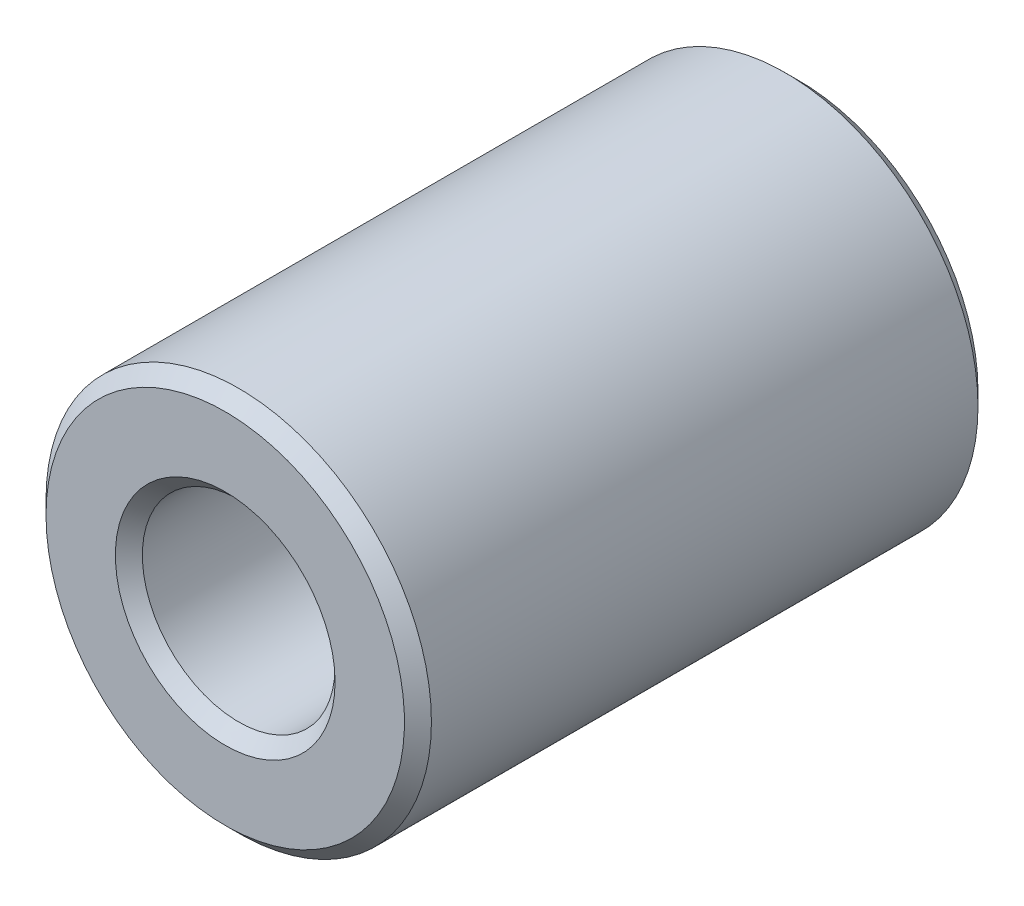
from build123d import *

# Parameters (mm, degrees)
BOSS_EXTRUDE1_DEPTH      = 4.7625
BOSS_EXTRUDE1_DEPTH_BACK = 4.7625
SKETCH14_R               = 3.2004
SKETCH14_R_2             = 1.6002
CHAMFER1_SIZE            = 0.224028


with BuildPart() as part:
    # Sketch14 → Boss-Extrude1 (new, two sides: drawn at the far end of the back side and taken through both)
    with BuildSketch(Plane.XY.offset(-BOSS_EXTRUDE1_DEPTH_BACK)):
        Circle(SKETCH14_R)
        Circle(SKETCH14_R_2, mode=Mode.SUBTRACT)
    extrude(amount=BOSS_EXTRUDE1_DEPTH + BOSS_EXTRUDE1_DEPTH_BACK)

    # Chamfer1
    chamfer1_edges = [part.edges().sort_by_distance(p)[0] for p in [
        (-3.2004, 0, -4.7625),
        (-1.6002, 0, -4.7625),
        (-3.2004, 0, 4.7625),
        (-1.6002, 0, 4.7625),
    ]]
    chamfer(chamfer1_edges, length=CHAMFER1_SIZE)


solid = part.part
